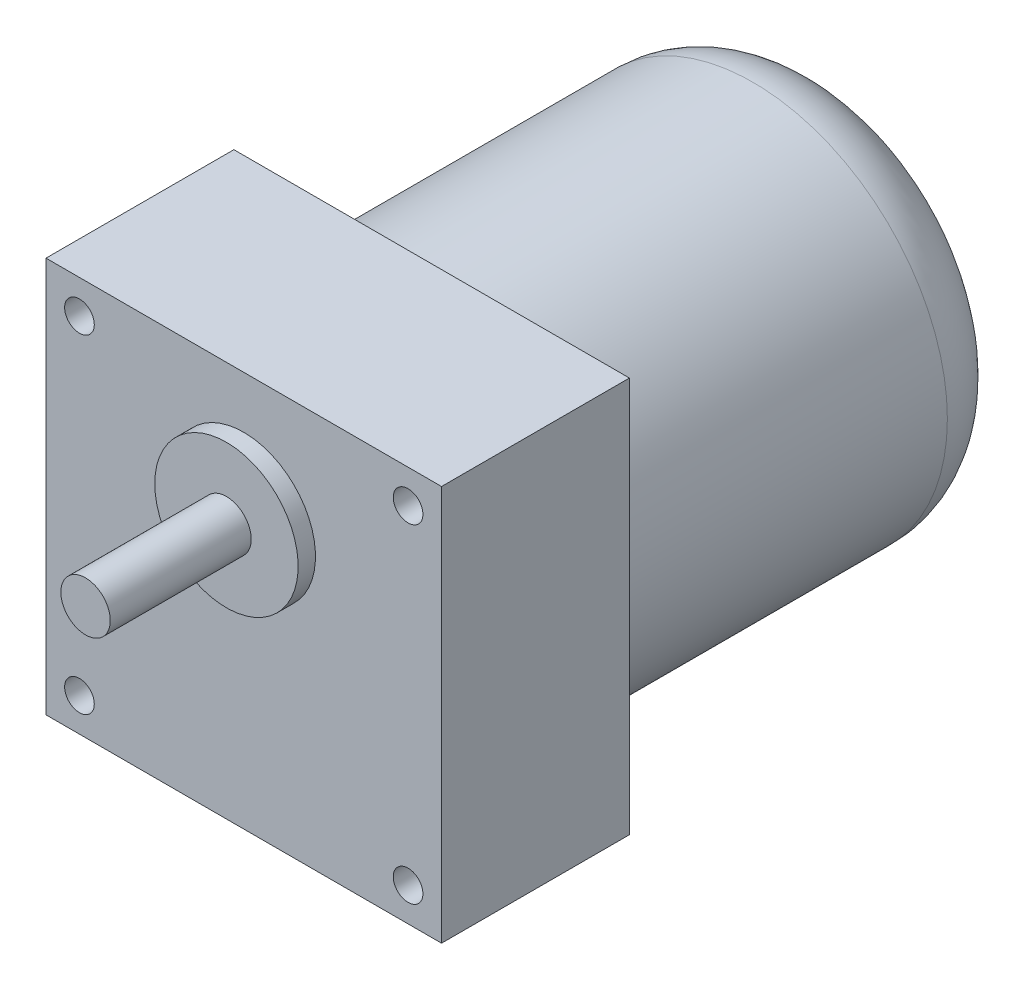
ISO-10303-21;
HEADER;
FILE_DESCRIPTION(('STEP AP214'),'2;1');
FILE_NAME('part.step','',(''),(''),'','','');
FILE_SCHEMA(('AUTOMOTIVE_DESIGN { 1 0 10303 214 1 1 1 1 }'));
ENDSEC;
DATA;
#1=APPLICATION_CONTEXT('core data for automotive mechanical design processes');
#2=APPLICATION_PROTOCOL_DEFINITION('international standard','automotive_design',2000,#1);
#3=PRODUCT_CONTEXT('',#1,'mechanical');
#4=PRODUCT('Part','Part','',(#3));
#5=PRODUCT_RELATED_PRODUCT_CATEGORY('part','',(#4));
#6=PRODUCT_DEFINITION_FORMATION('','',#4);
#7=PRODUCT_DEFINITION_CONTEXT('part definition',#1,'design');
#8=PRODUCT_DEFINITION('design','',#6,#7);
#9=PRODUCT_DEFINITION_SHAPE('','',#8);
#10=(LENGTH_UNIT() NAMED_UNIT(*) SI_UNIT(.MILLI.,.METRE.));
#11=(NAMED_UNIT(*) PLANE_ANGLE_UNIT() SI_UNIT($,.RADIAN.));
#12=(NAMED_UNIT(*) SI_UNIT($,.STERADIAN.) SOLID_ANGLE_UNIT());
#13=UNCERTAINTY_MEASURE_WITH_UNIT(LENGTH_MEASURE(1.E-05),#10,'distance_accuracy_value','');
#14=(GEOMETRIC_REPRESENTATION_CONTEXT(3) GLOBAL_UNCERTAINTY_ASSIGNED_CONTEXT((#13)) GLOBAL_UNIT_ASSIGNED_CONTEXT((#10,
#11,#12)) REPRESENTATION_CONTEXT('',''));
#15=CARTESIAN_POINT('',(0.,0.,0.));
#16=DIRECTION('',(0.,0.,1.));
#17=DIRECTION('',(1.,0.,0.));
#18=AXIS2_PLACEMENT_3D('',#15,#16,#17);
#19=CARTESIAN_POINT('',(0.,15.,70.));
#20=DIRECTION('',(0.,0.,1.));
#21=DIRECTION('',(1.,0.,0.));
#22=AXIS2_PLACEMENT_3D('',#19,#20,#21);
#23=PLANE('',#22);
#24=CARTESIAN_POINT('',(0.,15.,70.));
#25=DIRECTION('',(0.,0.,-1.));
#26=DIRECTION('',(-1.,0.,0.));
#27=AXIS2_PLACEMENT_3D('',#24,#25,#26);
#28=CIRCLE('',#27,5.);
#29=CARTESIAN_POINT('',(-5.,15.,70.));
#30=VERTEX_POINT('',#29);
#31=EDGE_CURVE('E245',#30,#30,#28,.T.);
#32=ORIENTED_EDGE('',*,*,#31,.F.);
#33=EDGE_LOOP('',(#32));
#34=FACE_BOUND('',#33,.T.);
#35=ADVANCED_FACE('F17',(#34),#23,.T.);
#36=CARTESIAN_POINT('',(0.,15.,70.));
#37=DIRECTION('',(0.,0.,-1.));
#38=DIRECTION('',(-1.,0.,0.));
#39=AXIS2_PLACEMENT_3D('',#36,#37,#38);
#40=CYLINDRICAL_SURFACE('',#39,5.);
#41=CARTESIAN_POINT('',(0.,15.,41.5));
#42=DIRECTION('',(0.,0.,-1.));
#43=DIRECTION('',(-1.,0.,0.));
#44=AXIS2_PLACEMENT_3D('',#41,#42,#43);
#45=CIRCLE('',#44,5.);
#46=CARTESIAN_POINT('',(-5.,15.,41.5));
#47=VERTEX_POINT('',#46);
#48=EDGE_CURVE('E77',#47,#47,#45,.T.);
#49=ORIENTED_EDGE('',*,*,#48,.F.);
#50=EDGE_LOOP('',(#49));
#51=FACE_BOUND('',#50,.T.);
#52=ORIENTED_EDGE('',*,*,#31,.T.);
#53=EDGE_LOOP('',(#52));
#54=FACE_BOUND('',#53,.T.);
#55=ADVANCED_FACE('F118',(#51,#54),#40,.T.);
#56=CARTESIAN_POINT('',(0.,0.,-90.));
#57=DIRECTION('',(0.,0.,-1.));
#58=DIRECTION('',(-1.,0.,0.));
#59=AXIS2_PLACEMENT_3D('',#56,#57,#58);
#60=PLANE('',#59);
#61=CARTESIAN_POINT('',(0.,0.,-90.));
#62=DIRECTION('',(0.,0.,1.));
#63=DIRECTION('',(1.,0.,0.));
#64=AXIS2_PLACEMENT_3D('',#61,#62,#63);
#65=CIRCLE('',#64,8.26185028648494);
#66=CARTESIAN_POINT('',(8.26185028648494,0.,-90.));
#67=VERTEX_POINT('',#66);
#68=CARTESIAN_POINT('',(-8.26185028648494,0.,-90.));
#69=VERTEX_POINT('',#68);
#70=EDGE_CURVE('E75',#67,#69,#65,.T.);
#71=ORIENTED_EDGE('',*,*,#70,.F.);
#72=CARTESIAN_POINT('',(0.,0.,-90.));
#73=DIRECTION('',(0.,0.,1.));
#74=DIRECTION('',(-1.,0.,0.));
#75=AXIS2_PLACEMENT_3D('',#72,#73,#74);
#76=CIRCLE('',#75,8.26185028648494);
#77=EDGE_CURVE('E70',#69,#67,#76,.T.);
#78=ORIENTED_EDGE('',*,*,#77,.F.);
#79=EDGE_LOOP('',(#71,#78));
#80=FACE_BOUND('',#79,.T.);
#81=ADVANCED_FACE('F74',(#80),#60,.T.);
#82=CARTESIAN_POINT('',(0.,15.,41.5));
#83=DIRECTION('',(0.,0.,1.));
#84=DIRECTION('',(1.,0.,0.));
#85=AXIS2_PLACEMENT_3D('',#82,#83,#84);
#86=PLANE('',#85);
#87=ORIENTED_EDGE('',*,*,#48,.T.);
#88=EDGE_LOOP('',(#87));
#89=FACE_BOUND('',#88,.T.);
#90=CARTESIAN_POINT('',(0.,15.,41.5));
#91=DIRECTION('',(0.,0.,-1.));
#92=DIRECTION('',(-1.,0.,0.));
#93=AXIS2_PLACEMENT_3D('',#90,#91,#92);
#94=CIRCLE('',#93,14.5);
#95=CARTESIAN_POINT('',(-14.5,15.,41.5));
#96=VERTEX_POINT('',#95);
#97=EDGE_CURVE('E83',#96,#96,#94,.T.);
#98=ORIENTED_EDGE('',*,*,#97,.F.);
#99=EDGE_LOOP('',(#98));
#100=FACE_BOUND('',#99,.T.);
#101=ADVANCED_FACE('F102',(#89,#100),#86,.T.);
#102=CARTESIAN_POINT('',(0.,0.,-82.));
#103=DIRECTION('',(0.,0.,-1.));
#104=DIRECTION('',(-1.,0.,0.));
#105=AXIS2_PLACEMENT_3D('',#102,#103,#104);
#106=TOROIDAL_SURFACE('',#105,8.26185028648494,8.);
#107=ORIENTED_EDGE('',*,*,#77,.T.);
#108=ORIENTED_EDGE('',*,*,#70,.T.);
#109=EDGE_LOOP('',(#107,#108));
#110=FACE_BOUND('',#109,.T.);
#111=CARTESIAN_POINT('',(0.,0.,-82.));
#112=DIRECTION('',(0.,0.,1.));
#113=DIRECTION('',(1.,0.,0.));
#114=AXIS2_PLACEMENT_3D('',#111,#112,#113);
#115=CIRCLE('',#114,16.2618502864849);
#116=CARTESIAN_POINT('',(16.2618502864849,0.,-82.));
#117=VERTEX_POINT('',#116);
#118=EDGE_CURVE('E107',#117,#117,#115,.T.);
#119=ORIENTED_EDGE('',*,*,#118,.F.);
#120=EDGE_LOOP('',(#119));
#121=FACE_BOUND('',#120,.T.);
#122=ADVANCED_FACE('F81',(#110,#121),#106,.T.);
#123=CARTESIAN_POINT('',(0.,15.,41.5));
#124=DIRECTION('',(0.,0.,-1.));
#125=DIRECTION('',(-1.,0.,0.));
#126=AXIS2_PLACEMENT_3D('',#123,#124,#125);
#127=CYLINDRICAL_SURFACE('',#126,14.5);
#128=CARTESIAN_POINT('',(0.,15.,38.));
#129=DIRECTION('',(0.,0.,-1.));
#130=DIRECTION('',(-1.,0.,0.));
#131=AXIS2_PLACEMENT_3D('',#128,#129,#130);
#132=CIRCLE('',#131,14.5);
#133=CARTESIAN_POINT('',(-14.5,15.,38.));
#134=VERTEX_POINT('',#133);
#135=EDGE_CURVE('E238',#134,#134,#132,.T.);
#136=ORIENTED_EDGE('',*,*,#135,.F.);
#137=EDGE_LOOP('',(#136));
#138=FACE_BOUND('',#137,.T.);
#139=ORIENTED_EDGE('',*,*,#97,.T.);
#140=EDGE_LOOP('',(#139));
#141=FACE_BOUND('',#140,.T.);
#142=ADVANCED_FACE('F101',(#138,#141),#127,.T.);
#143=CARTESIAN_POINT('',(0.,0.,-90.));
#144=DIRECTION('',(0.,0.,1.));
#145=DIRECTION('',(1.,0.,0.));
#146=AXIS2_PLACEMENT_3D('',#143,#144,#145);
#147=CYLINDRICAL_SURFACE('',#146,16.2618502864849);
#148=CARTESIAN_POINT('',(0.,0.,-80.));
#149=DIRECTION('',(0.,0.,1.));
#150=DIRECTION('',(1.,0.,0.));
#151=AXIS2_PLACEMENT_3D('',#148,#149,#150);
#152=CIRCLE('',#151,16.2618502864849);
#153=CARTESIAN_POINT('',(16.2618502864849,0.,-80.));
#154=VERTEX_POINT('',#153);
#155=EDGE_CURVE('E235',#154,#154,#152,.T.);
#156=ORIENTED_EDGE('',*,*,#155,.F.);
#157=EDGE_LOOP('',(#156));
#158=FACE_BOUND('',#157,.T.);
#159=ORIENTED_EDGE('',*,*,#118,.T.);
#160=EDGE_LOOP('',(#159));
#161=FACE_BOUND('',#160,.T.);
#162=ADVANCED_FACE('F262',(#158,#161),#147,.T.);
#163=CARTESIAN_POINT('',(0.,0.,38.));
#164=DIRECTION('',(0.,0.,1.));
#165=DIRECTION('',(1.,0.,0.));
#166=AXIS2_PLACEMENT_3D('',#163,#164,#165);
#167=PLANE('',#166);
#168=ORIENTED_EDGE('',*,*,#135,.T.);
#169=EDGE_LOOP('',(#168));
#170=FACE_BOUND('',#169,.T.);
#171=DIRECTION('',(0.,1.,0.));
#172=VECTOR('',#171,1.);
#173=CARTESIAN_POINT('',(-40.,40.,38.));
#174=LINE('',#173,#172);
#175=CARTESIAN_POINT('',(-40.,40.,38.));
#176=VERTEX_POINT('',#175);
#177=CARTESIAN_POINT('',(-40.,-40.,38.));
#178=VERTEX_POINT('',#177);
#179=EDGE_CURVE('E166',#176,#178,#174,.F.);
#180=ORIENTED_EDGE('',*,*,#179,.T.);
#181=DIRECTION('',(1.,0.,0.));
#182=VECTOR('',#181,1.);
#183=CARTESIAN_POINT('',(-40.,-40.,38.));
#184=LINE('',#183,#182);
#185=CARTESIAN_POINT('',(40.,-40.,38.));
#186=VERTEX_POINT('',#185);
#187=EDGE_CURVE('E161',#178,#186,#184,.T.);
#188=ORIENTED_EDGE('',*,*,#187,.T.);
#189=DIRECTION('',(0.,-1.,0.));
#190=VECTOR('',#189,1.);
#191=CARTESIAN_POINT('',(40.,40.,38.));
#192=LINE('',#191,#190);
#193=CARTESIAN_POINT('',(40.,40.,38.));
#194=VERTEX_POINT('',#193);
#195=EDGE_CURVE('E157',#186,#194,#192,.F.);
#196=ORIENTED_EDGE('',*,*,#195,.T.);
#197=DIRECTION('',(1.,0.,0.));
#198=VECTOR('',#197,1.);
#199=CARTESIAN_POINT('',(-40.,40.,38.));
#200=LINE('',#199,#198);
#201=EDGE_CURVE('E171',#194,#176,#200,.F.);
#202=ORIENTED_EDGE('',*,*,#201,.T.);
#203=EDGE_LOOP('',(#180,#188,#196,#202));
#204=FACE_BOUND('',#203,.T.);
#205=CARTESIAN_POINT('',(-33.2340187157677,33.2340187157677,38.));
#206=DIRECTION('',(0.,0.,1.));
#207=DIRECTION('',(1.,0.,0.));
#208=AXIS2_PLACEMENT_3D('',#205,#206,#207);
#209=CIRCLE('',#208,3.);
#210=CARTESIAN_POINT('',(-30.2340187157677,33.2340187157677,38.));
#211=VERTEX_POINT('',#210);
#212=EDGE_CURVE('E156',#211,#211,#209,.F.);
#213=ORIENTED_EDGE('',*,*,#212,.T.);
#214=EDGE_LOOP('',(#213));
#215=FACE_BOUND('',#214,.T.);
#216=CARTESIAN_POINT('',(-33.2340187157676,-33.2340187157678,38.));
#217=DIRECTION('',(0.,0.,1.));
#218=DIRECTION('',(1.,0.,0.));
#219=AXIS2_PLACEMENT_3D('',#216,#217,#218);
#220=CIRCLE('',#219,3.);
#221=CARTESIAN_POINT('',(-30.2340187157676,-33.2340187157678,38.));
#222=VERTEX_POINT('',#221);
#223=EDGE_CURVE('E173',#222,#222,#220,.F.);
#224=ORIENTED_EDGE('',*,*,#223,.T.);
#225=EDGE_LOOP('',(#224));
#226=FACE_BOUND('',#225,.T.);
#227=CARTESIAN_POINT('',(33.2340187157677,-33.2340187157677,38.));
#228=DIRECTION('',(0.,0.,1.));
#229=DIRECTION('',(1.,0.,0.));
#230=AXIS2_PLACEMENT_3D('',#227,#228,#229);
#231=CIRCLE('',#230,3.);
#232=CARTESIAN_POINT('',(36.2340187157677,-33.2340187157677,38.));
#233=VERTEX_POINT('',#232);
#234=EDGE_CURVE('E229',#233,#233,#231,.F.);
#235=ORIENTED_EDGE('',*,*,#234,.T.);
#236=EDGE_LOOP('',(#235));
#237=FACE_BOUND('',#236,.T.);
#238=CARTESIAN_POINT('',(33.2340187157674,33.2340187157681,38.));
#239=DIRECTION('',(0.,0.,1.));
#240=DIRECTION('',(1.,0.,0.));
#241=AXIS2_PLACEMENT_3D('',#238,#239,#240);
#242=CIRCLE('',#241,3.);
#243=CARTESIAN_POINT('',(36.2340187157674,33.2340187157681,38.));
#244=VERTEX_POINT('',#243);
#245=EDGE_CURVE('E232',#244,#244,#242,.F.);
#246=ORIENTED_EDGE('',*,*,#245,.T.);
#247=EDGE_LOOP('',(#246));
#248=FACE_BOUND('',#247,.T.);
#249=ADVANCED_FACE('F195',(#170,#204,#215,#226,#237,#248),#167,.T.);
#250=CARTESIAN_POINT('',(0.,0.,-80.));
#251=DIRECTION('',(0.,0.,-1.));
#252=DIRECTION('',(-1.,0.,0.));
#253=AXIS2_PLACEMENT_3D('',#250,#251,#252);
#254=PLANE('',#253);
#255=ORIENTED_EDGE('',*,*,#155,.T.);
#256=EDGE_LOOP('',(#255));
#257=FACE_BOUND('',#256,.T.);
#258=CARTESIAN_POINT('',(0.,0.,-80.));
#259=DIRECTION('',(0.,0.,1.));
#260=DIRECTION('',(1.,0.,0.));
#261=AXIS2_PLACEMENT_3D('',#258,#259,#260);
#262=CIRCLE('',#261,24.3100736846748);
#263=CARTESIAN_POINT('',(24.3100736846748,0.,-80.));
#264=VERTEX_POINT('',#263);
#265=CARTESIAN_POINT('',(-24.3100736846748,0.,-80.));
#266=VERTEX_POINT('',#265);
#267=EDGE_CURVE('E178',#264,#266,#262,.T.);
#268=ORIENTED_EDGE('',*,*,#267,.F.);
#269=CARTESIAN_POINT('',(0.,0.,-80.));
#270=DIRECTION('',(0.,0.,1.));
#271=DIRECTION('',(-1.,0.,0.));
#272=AXIS2_PLACEMENT_3D('',#269,#270,#271);
#273=CIRCLE('',#272,24.3100736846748);
#274=EDGE_CURVE('E215',#266,#264,#273,.T.);
#275=ORIENTED_EDGE('',*,*,#274,.F.);
#276=EDGE_LOOP('',(#268,#275));
#277=FACE_BOUND('',#276,.T.);
#278=ADVANCED_FACE('F184',(#257,#277),#254,.T.);
#279=CARTESIAN_POINT('',(33.2340187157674,33.2340187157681,-90.));
#280=DIRECTION('',(0.,0.,1.));
#281=DIRECTION('',(1.,0.,0.));
#282=AXIS2_PLACEMENT_3D('',#279,#280,#281);
#283=CYLINDRICAL_SURFACE('',#282,3.);
#284=CARTESIAN_POINT('',(33.2340187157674,33.2340187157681,0.));
#285=DIRECTION('',(0.,0.,1.));
#286=DIRECTION('',(1.,0.,0.));
#287=AXIS2_PLACEMENT_3D('',#284,#285,#286);
#288=CIRCLE('',#287,3.);
#289=CARTESIAN_POINT('',(36.2340187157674,33.2340187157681,0.));
#290=VERTEX_POINT('',#289);
#291=EDGE_CURVE('E217',#290,#290,#288,.F.);
#292=ORIENTED_EDGE('',*,*,#291,.T.);
#293=EDGE_LOOP('',(#292));
#294=FACE_BOUND('',#293,.T.);
#295=ORIENTED_EDGE('',*,*,#245,.F.);
#296=EDGE_LOOP('',(#295));
#297=FACE_BOUND('',#296,.T.);
#298=ADVANCED_FACE('F194',(#294,#297),#283,.F.);
#299=CARTESIAN_POINT('',(33.2340187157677,-33.2340187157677,-90.));
#300=DIRECTION('',(0.,0.,1.));
#301=DIRECTION('',(1.,0.,0.));
#302=AXIS2_PLACEMENT_3D('',#299,#300,#301);
#303=CYLINDRICAL_SURFACE('',#302,3.);
#304=CARTESIAN_POINT('',(33.2340187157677,-33.2340187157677,0.));
#305=DIRECTION('',(0.,0.,1.));
#306=DIRECTION('',(1.,0.,0.));
#307=AXIS2_PLACEMENT_3D('',#304,#305,#306);
#308=CIRCLE('',#307,3.);
#309=CARTESIAN_POINT('',(36.2340187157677,-33.2340187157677,0.));
#310=VERTEX_POINT('',#309);
#311=EDGE_CURVE('E219',#310,#310,#308,.F.);
#312=ORIENTED_EDGE('',*,*,#311,.T.);
#313=EDGE_LOOP('',(#312));
#314=FACE_BOUND('',#313,.T.);
#315=ORIENTED_EDGE('',*,*,#234,.F.);
#316=EDGE_LOOP('',(#315));
#317=FACE_BOUND('',#316,.T.);
#318=ADVANCED_FACE('F281',(#314,#317),#303,.F.);
#319=CARTESIAN_POINT('',(-33.2340187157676,-33.2340187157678,-90.));
#320=DIRECTION('',(0.,0.,1.));
#321=DIRECTION('',(1.,0.,0.));
#322=AXIS2_PLACEMENT_3D('',#319,#320,#321);
#323=CYLINDRICAL_SURFACE('',#322,3.);
#324=CARTESIAN_POINT('',(-33.2340187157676,-33.2340187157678,0.));
#325=DIRECTION('',(0.,0.,1.));
#326=DIRECTION('',(1.,0.,0.));
#327=AXIS2_PLACEMENT_3D('',#324,#325,#326);
#328=CIRCLE('',#327,3.);
#329=CARTESIAN_POINT('',(-30.2340187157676,-33.2340187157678,0.));
#330=VERTEX_POINT('',#329);
#331=EDGE_CURVE('E334',#330,#330,#328,.F.);
#332=ORIENTED_EDGE('',*,*,#331,.T.);
#333=EDGE_LOOP('',(#332));
#334=FACE_BOUND('',#333,.T.);
#335=ORIENTED_EDGE('',*,*,#223,.F.);
#336=EDGE_LOOP('',(#335));
#337=FACE_BOUND('',#336,.T.);
#338=ADVANCED_FACE('F286',(#334,#337),#323,.F.);
#339=CARTESIAN_POINT('',(-40.,40.,38.));
#340=DIRECTION('',(0.,-1.,0.));
#341=DIRECTION('',(0.,0.,-1.));
#342=AXIS2_PLACEMENT_3D('',#339,#340,#341);
#343=PLANE('',#342);
#344=DIRECTION('',(0.,0.,1.));
#345=VECTOR('',#344,1.);
#346=CARTESIAN_POINT('',(-40.,40.,38.));
#347=LINE('',#346,#345);
#348=CARTESIAN_POINT('',(-40.,40.,0.));
#349=VERTEX_POINT('',#348);
#350=EDGE_CURVE('E168',#349,#176,#347,.T.);
#351=ORIENTED_EDGE('',*,*,#350,.T.);
#352=ORIENTED_EDGE('',*,*,#201,.F.);
#353=DIRECTION('',(0.,0.,1.));
#354=VECTOR('',#353,1.);
#355=CARTESIAN_POINT('',(40.,40.,38.));
#356=LINE('',#355,#354);
#357=CARTESIAN_POINT('',(40.,40.,0.));
#358=VERTEX_POINT('',#357);
#359=EDGE_CURVE('E154',#194,#358,#356,.F.);
#360=ORIENTED_EDGE('',*,*,#359,.T.);
#361=DIRECTION('',(1.,0.,0.));
#362=VECTOR('',#361,1.);
#363=CARTESIAN_POINT('',(0.,40.,0.));
#364=LINE('',#363,#362);
#365=EDGE_CURVE('E322',#358,#349,#364,.F.);
#366=ORIENTED_EDGE('',*,*,#365,.T.);
#367=EDGE_LOOP('',(#351,#352,#360,#366));
#368=FACE_BOUND('',#367,.T.);
#369=ADVANCED_FACE('F293',(#368),#343,.F.);
#370=CARTESIAN_POINT('',(-40.,40.,38.));
#371=DIRECTION('',(1.,0.,0.));
#372=DIRECTION('',(0.,1.,0.));
#373=AXIS2_PLACEMENT_3D('',#370,#371,#372);
#374=PLANE('',#373);
#375=DIRECTION('',(0.,0.,1.));
#376=VECTOR('',#375,1.);
#377=CARTESIAN_POINT('',(-40.,-40.,38.));
#378=LINE('',#377,#376);
#379=CARTESIAN_POINT('',(-40.,-40.,0.));
#380=VERTEX_POINT('',#379);
#381=EDGE_CURVE('E163',#380,#178,#378,.T.);
#382=ORIENTED_EDGE('',*,*,#381,.T.);
#383=ORIENTED_EDGE('',*,*,#179,.F.);
#384=ORIENTED_EDGE('',*,*,#350,.F.);
#385=DIRECTION('',(0.,1.,0.));
#386=VECTOR('',#385,1.);
#387=CARTESIAN_POINT('',(-40.,0.,0.));
#388=LINE('',#387,#386);
#389=EDGE_CURVE('E331',#349,#380,#388,.F.);
#390=ORIENTED_EDGE('',*,*,#389,.T.);
#391=EDGE_LOOP('',(#382,#383,#384,#390));
#392=FACE_BOUND('',#391,.T.);
#393=ADVANCED_FACE('F301',(#392),#374,.F.);
#394=CARTESIAN_POINT('',(-40.,-40.,38.));
#395=DIRECTION('',(0.,1.,0.));
#396=DIRECTION('',(0.,0.,1.));
#397=AXIS2_PLACEMENT_3D('',#394,#395,#396);
#398=PLANE('',#397);
#399=DIRECTION('',(0.,0.,1.));
#400=VECTOR('',#399,1.);
#401=CARTESIAN_POINT('',(40.,-40.,38.));
#402=LINE('',#401,#400);
#403=CARTESIAN_POINT('',(40.,-40.,0.));
#404=VERTEX_POINT('',#403);
#405=EDGE_CURVE('E159',#404,#186,#402,.T.);
#406=ORIENTED_EDGE('',*,*,#405,.T.);
#407=ORIENTED_EDGE('',*,*,#187,.F.);
#408=ORIENTED_EDGE('',*,*,#381,.F.);
#409=DIRECTION('',(1.,0.,0.));
#410=VECTOR('',#409,1.);
#411=CARTESIAN_POINT('',(0.,-40.,0.));
#412=LINE('',#411,#410);
#413=EDGE_CURVE('E37',#380,#404,#412,.T.);
#414=ORIENTED_EDGE('',*,*,#413,.T.);
#415=EDGE_LOOP('',(#406,#407,#408,#414));
#416=FACE_BOUND('',#415,.T.);
#417=ADVANCED_FACE('F305',(#416),#398,.F.);
#418=CARTESIAN_POINT('',(40.,40.,38.));
#419=DIRECTION('',(-1.,0.,0.));
#420=DIRECTION('',(0.,-1.,0.));
#421=AXIS2_PLACEMENT_3D('',#418,#419,#420);
#422=PLANE('',#421);
#423=ORIENTED_EDGE('',*,*,#359,.F.);
#424=ORIENTED_EDGE('',*,*,#195,.F.);
#425=ORIENTED_EDGE('',*,*,#405,.F.);
#426=DIRECTION('',(0.,1.,0.));
#427=VECTOR('',#426,1.);
#428=CARTESIAN_POINT('',(40.,0.,0.));
#429=LINE('',#428,#427);
#430=EDGE_CURVE('E319',#404,#358,#429,.T.);
#431=ORIENTED_EDGE('',*,*,#430,.T.);
#432=EDGE_LOOP('',(#423,#424,#425,#431));
#433=FACE_BOUND('',#432,.T.);
#434=ADVANCED_FACE('F308',(#433),#422,.F.);
#435=CARTESIAN_POINT('',(-33.2340187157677,33.2340187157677,0.));
#436=DIRECTION('',(0.,0.,1.));
#437=DIRECTION('',(1.,0.,0.));
#438=AXIS2_PLACEMENT_3D('',#435,#436,#437);
#439=CYLINDRICAL_SURFACE('',#438,3.);
#440=CARTESIAN_POINT('',(-33.2340187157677,33.2340187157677,0.));
#441=DIRECTION('',(0.,0.,1.));
#442=DIRECTION('',(1.,0.,0.));
#443=AXIS2_PLACEMENT_3D('',#440,#441,#442);
#444=CIRCLE('',#443,3.);
#445=CARTESIAN_POINT('',(-30.2340187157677,33.2340187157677,0.));
#446=VERTEX_POINT('',#445);
#447=EDGE_CURVE('E328',#446,#446,#444,.F.);
#448=ORIENTED_EDGE('',*,*,#447,.T.);
#449=EDGE_LOOP('',(#448));
#450=FACE_BOUND('',#449,.T.);
#451=ORIENTED_EDGE('',*,*,#212,.F.);
#452=EDGE_LOOP('',(#451));
#453=FACE_BOUND('',#452,.T.);
#454=ADVANCED_FACE('F146',(#450,#453),#439,.F.);
#455=CARTESIAN_POINT('',(0.,0.,-65.));
#456=DIRECTION('',(0.,0.,-1.));
#457=DIRECTION('',(-1.,0.,0.));
#458=AXIS2_PLACEMENT_3D('',#455,#456,#457);
#459=TOROIDAL_SURFACE('',#458,24.3100736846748,15.);
#460=ORIENTED_EDGE('',*,*,#274,.T.);
#461=ORIENTED_EDGE('',*,*,#267,.T.);
#462=EDGE_LOOP('',(#460,#461));
#463=FACE_BOUND('',#462,.T.);
#464=CARTESIAN_POINT('',(0.,0.,-65.));
#465=DIRECTION('',(0.,0.,1.));
#466=DIRECTION('',(1.,0.,0.));
#467=AXIS2_PLACEMENT_3D('',#464,#465,#466);
#468=CIRCLE('',#467,39.3100736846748);
#469=CARTESIAN_POINT('',(39.3100736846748,0.,-65.));
#470=VERTEX_POINT('',#469);
#471=EDGE_CURVE('E28',#470,#470,#468,.T.);
#472=ORIENTED_EDGE('',*,*,#471,.F.);
#473=EDGE_LOOP('',(#472));
#474=FACE_BOUND('',#473,.T.);
#475=ADVANCED_FACE('F137',(#463,#474),#459,.T.);
#476=CARTESIAN_POINT('',(0.,0.,0.));
#477=DIRECTION('',(0.,0.,1.));
#478=DIRECTION('',(1.,0.,0.));
#479=AXIS2_PLACEMENT_3D('',#476,#477,#478);
#480=PLANE('',#479);
#481=CARTESIAN_POINT('',(0.,0.,0.));
#482=DIRECTION('',(0.,0.,1.));
#483=DIRECTION('',(1.,0.,0.));
#484=AXIS2_PLACEMENT_3D('',#481,#482,#483);
#485=CIRCLE('',#484,39.3100736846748);
#486=CARTESIAN_POINT('',(39.3100736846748,0.,0.));
#487=VERTEX_POINT('',#486);
#488=EDGE_CURVE('E11',#487,#487,#485,.F.);
#489=ORIENTED_EDGE('',*,*,#488,.F.);
#490=EDGE_LOOP('',(#489));
#491=FACE_BOUND('',#490,.T.);
#492=ORIENTED_EDGE('',*,*,#447,.F.);
#493=EDGE_LOOP('',(#492));
#494=FACE_BOUND('',#493,.T.);
#495=ORIENTED_EDGE('',*,*,#413,.F.);
#496=ORIENTED_EDGE('',*,*,#389,.F.);
#497=ORIENTED_EDGE('',*,*,#365,.F.);
#498=ORIENTED_EDGE('',*,*,#430,.F.);
#499=EDGE_LOOP('',(#495,#496,#497,#498));
#500=FACE_BOUND('',#499,.T.);
#501=ORIENTED_EDGE('',*,*,#331,.F.);
#502=EDGE_LOOP('',(#501));
#503=FACE_BOUND('',#502,.T.);
#504=ORIENTED_EDGE('',*,*,#311,.F.);
#505=EDGE_LOOP('',(#504));
#506=FACE_BOUND('',#505,.T.);
#507=ORIENTED_EDGE('',*,*,#291,.F.);
#508=EDGE_LOOP('',(#507));
#509=FACE_BOUND('',#508,.T.);
#510=ADVANCED_FACE('F131',(#491,#494,#500,#503,#506,#509),#480,.F.);
#511=CARTESIAN_POINT('',(0.,0.,-80.));
#512=DIRECTION('',(0.,0.,1.));
#513=DIRECTION('',(1.,0.,0.));
#514=AXIS2_PLACEMENT_3D('',#511,#512,#513);
#515=CYLINDRICAL_SURFACE('',#514,39.3100736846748);
#516=ORIENTED_EDGE('',*,*,#488,.T.);
#517=EDGE_LOOP('',(#516));
#518=FACE_BOUND('',#517,.T.);
#519=ORIENTED_EDGE('',*,*,#471,.T.);
#520=EDGE_LOOP('',(#519));
#521=FACE_BOUND('',#520,.T.);
#522=ADVANCED_FACE('F129',(#518,#521),#515,.T.);
#523=CLOSED_SHELL('',(#35,#55,#81,#101,#122,#142,#162,#249,#278,#298,#318,#338,#369,#393,#417,
#434,#454,#475,#510,#522));
#524=MANIFOLD_SOLID_BREP('B1',#523);
#525=ADVANCED_BREP_SHAPE_REPRESENTATION('',(#18,#524),#14);
#526=SHAPE_DEFINITION_REPRESENTATION(#9,#525);
ENDSEC;
END-ISO-10303-21;
